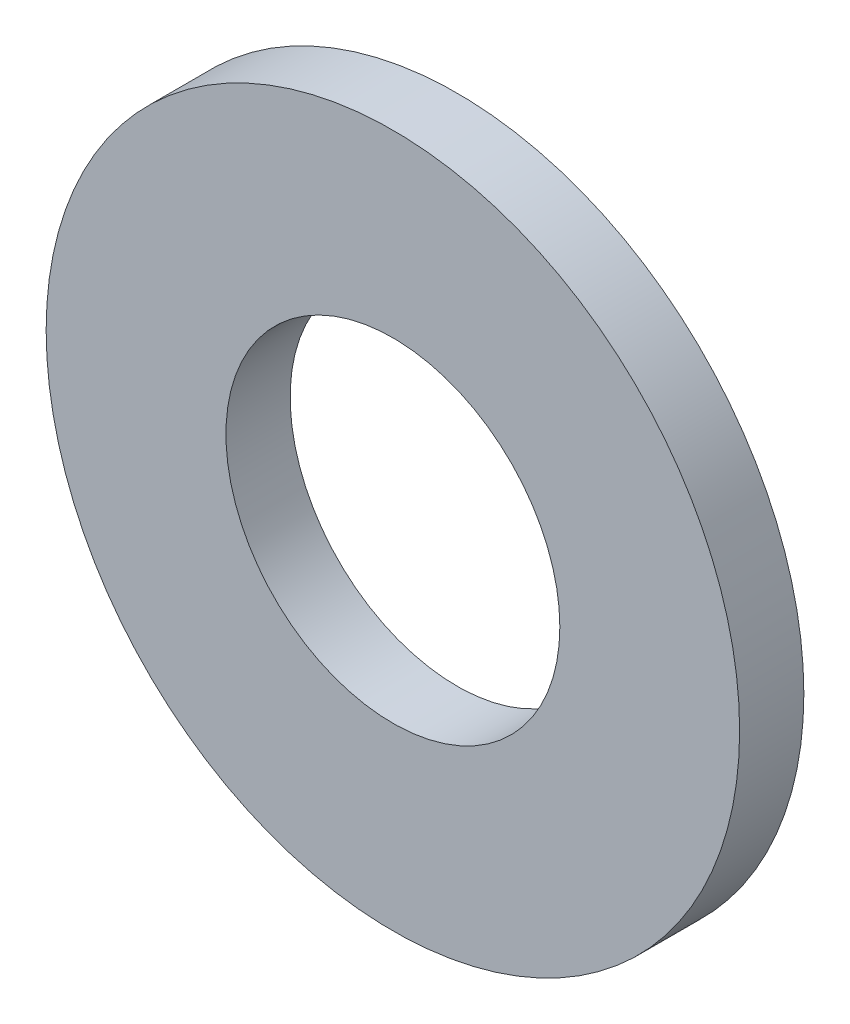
from build123d import *

# Parameters (mm, degrees)
ESQUISSE1_R      = 13.5
ESQUISSE1_R_2    = 6.5
EXTRUSION1_DEPTH = 2.5


with BuildPart() as part:
    # Esquisse1 → Extrusion1 (new body)
    with BuildSketch(Plane.XY):
        with Locations((67, 70)):
            Circle(ESQUISSE1_R)
        with Locations((67, 70)):
            Circle(ESQUISSE1_R_2, mode=Mode.SUBTRACT)
    extrude(amount=EXTRUSION1_DEPTH)


solid = part.part
